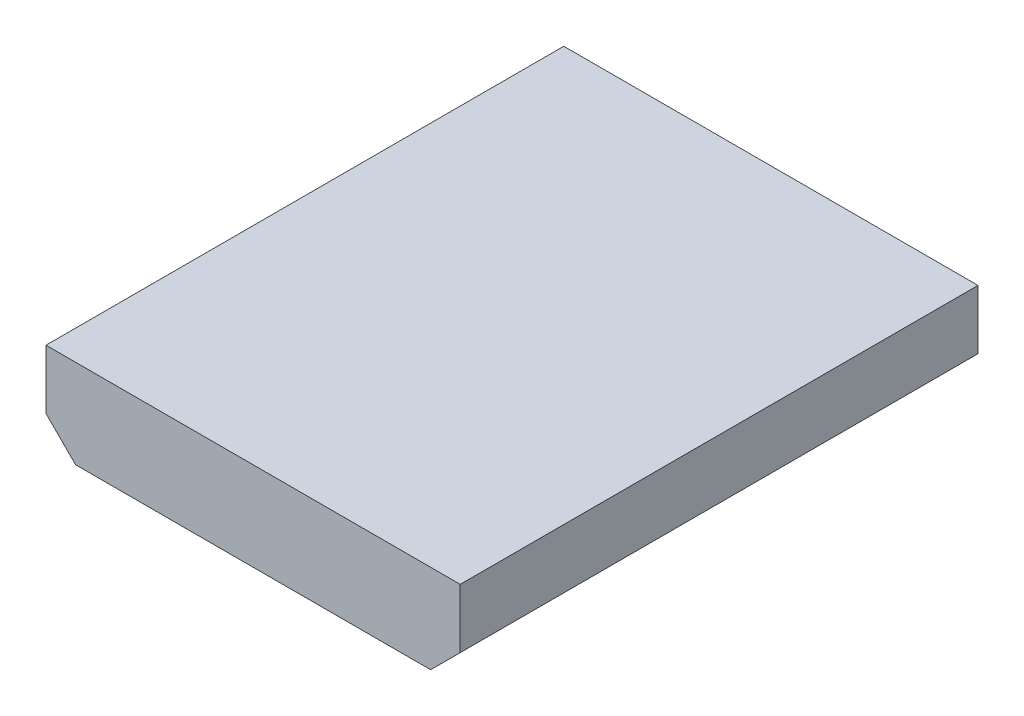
ISO-10303-21;
HEADER;
FILE_DESCRIPTION(('STEP AP214'),'2;1');
FILE_NAME('part.step','',(''),(''),'','','');
FILE_SCHEMA(('AUTOMOTIVE_DESIGN { 1 0 10303 214 1 1 1 1 }'));
ENDSEC;
DATA;
#1=APPLICATION_CONTEXT('core data for automotive mechanical design processes');
#2=APPLICATION_PROTOCOL_DEFINITION('international standard','automotive_design',2000,#1);
#3=PRODUCT_CONTEXT('',#1,'mechanical');
#4=PRODUCT('Part','Part','',(#3));
#5=PRODUCT_RELATED_PRODUCT_CATEGORY('part','',(#4));
#6=PRODUCT_DEFINITION_FORMATION('','',#4);
#7=PRODUCT_DEFINITION_CONTEXT('part definition',#1,'design');
#8=PRODUCT_DEFINITION('design','',#6,#7);
#9=PRODUCT_DEFINITION_SHAPE('','',#8);
#10=(LENGTH_UNIT() NAMED_UNIT(*) SI_UNIT(.MILLI.,.METRE.));
#11=(NAMED_UNIT(*) PLANE_ANGLE_UNIT() SI_UNIT($,.RADIAN.));
#12=(NAMED_UNIT(*) SI_UNIT($,.STERADIAN.) SOLID_ANGLE_UNIT());
#13=UNCERTAINTY_MEASURE_WITH_UNIT(LENGTH_MEASURE(1.E-05),#10,'distance_accuracy_value','');
#14=(GEOMETRIC_REPRESENTATION_CONTEXT(3) GLOBAL_UNCERTAINTY_ASSIGNED_CONTEXT((#13)) GLOBAL_UNIT_ASSIGNED_CONTEXT((#10,
#11,#12)) REPRESENTATION_CONTEXT('',''));
#15=CARTESIAN_POINT('',(0.,0.,0.));
#16=DIRECTION('',(0.,0.,1.));
#17=DIRECTION('',(1.,0.,0.));
#18=AXIS2_PLACEMENT_3D('',#15,#16,#17);
#19=CARTESIAN_POINT('',(-4.5,-4.5,8.75));
#20=DIRECTION('',(0.707106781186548,0.707106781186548,0.));
#21=DIRECTION('',(-0.707106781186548,0.707106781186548,0.));
#22=AXIS2_PLACEMENT_3D('',#19,#20,#21);
#23=PLANE('',#22);
#24=DIRECTION('',(0.707106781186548,-0.707106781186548,0.));
#25=VECTOR('',#24,1.);
#26=CARTESIAN_POINT('',(-4.5,-4.5,-8.75));
#27=LINE('',#26,#25);
#28=CARTESIAN_POINT('',(-7.,-2.,-8.75));
#29=VERTEX_POINT('',#28);
#30=CARTESIAN_POINT('',(-6.,-3.,-8.75));
#31=VERTEX_POINT('',#30);
#32=EDGE_CURVE('E119',#29,#31,#27,.T.);
#33=ORIENTED_EDGE('',*,*,#32,.T.);
#34=DIRECTION('',(0.,0.,-1.));
#35=VECTOR('',#34,1.);
#36=CARTESIAN_POINT('',(-6.,-3.,8.75));
#37=LINE('',#36,#35);
#38=CARTESIAN_POINT('',(-6.,-3.,8.75));
#39=VERTEX_POINT('',#38);
#40=EDGE_CURVE('E11',#39,#31,#37,.T.);
#41=ORIENTED_EDGE('',*,*,#40,.F.);
#42=DIRECTION('',(0.707106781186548,-0.707106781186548,0.));
#43=VECTOR('',#42,1.);
#44=CARTESIAN_POINT('',(-4.5,-4.5,8.75));
#45=LINE('',#44,#43);
#46=CARTESIAN_POINT('',(-7.,-2.,8.75));
#47=VERTEX_POINT('',#46);
#48=EDGE_CURVE('E129',#47,#39,#45,.T.);
#49=ORIENTED_EDGE('',*,*,#48,.F.);
#50=DIRECTION('',(0.,0.,-1.));
#51=VECTOR('',#50,1.);
#52=CARTESIAN_POINT('',(-7.,-2.,8.75));
#53=LINE('',#52,#51);
#54=EDGE_CURVE('E115',#47,#29,#53,.T.);
#55=ORIENTED_EDGE('',*,*,#54,.T.);
#56=EDGE_LOOP('',(#33,#41,#49,#55));
#57=FACE_BOUND('',#56,.T.);
#58=ADVANCED_FACE('F35',(#57),#23,.F.);
#59=CARTESIAN_POINT('',(0.,-3.,8.75));
#60=DIRECTION('',(0.,1.,0.));
#61=DIRECTION('',(0.,0.,1.));
#62=AXIS2_PLACEMENT_3D('',#59,#60,#61);
#63=PLANE('',#62);
#64=DIRECTION('',(1.,0.,0.));
#65=VECTOR('',#64,1.);
#66=CARTESIAN_POINT('',(0.,-3.,-8.75));
#67=LINE('',#66,#65);
#68=CARTESIAN_POINT('',(6.,-3.,-8.75));
#69=VERTEX_POINT('',#68);
#70=EDGE_CURVE('E122',#31,#69,#67,.T.);
#71=ORIENTED_EDGE('',*,*,#70,.T.);
#72=DIRECTION('',(0.,0.,-1.));
#73=VECTOR('',#72,1.);
#74=CARTESIAN_POINT('',(6.,-3.,8.75));
#75=LINE('',#74,#73);
#76=CARTESIAN_POINT('',(6.,-3.,8.75));
#77=VERTEX_POINT('',#76);
#78=EDGE_CURVE('E43',#77,#69,#75,.T.);
#79=ORIENTED_EDGE('',*,*,#78,.F.);
#80=DIRECTION('',(1.,0.,0.));
#81=VECTOR('',#80,1.);
#82=CARTESIAN_POINT('',(0.,-3.,8.75));
#83=LINE('',#82,#81);
#84=EDGE_CURVE('E88',#39,#77,#83,.T.);
#85=ORIENTED_EDGE('',*,*,#84,.F.);
#86=ORIENTED_EDGE('',*,*,#40,.T.);
#87=EDGE_LOOP('',(#71,#79,#85,#86));
#88=FACE_BOUND('',#87,.T.);
#89=ADVANCED_FACE('F153',(#88),#63,.F.);
#90=CARTESIAN_POINT('',(4.5,-4.5,8.75));
#91=DIRECTION('',(-0.707106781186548,0.707106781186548,0.));
#92=DIRECTION('',(-0.707106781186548,-0.707106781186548,0.));
#93=AXIS2_PLACEMENT_3D('',#90,#91,#92);
#94=PLANE('',#93);
#95=DIRECTION('',(0.707106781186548,0.707106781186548,0.));
#96=VECTOR('',#95,1.);
#97=CARTESIAN_POINT('',(4.5,-4.5,-8.75));
#98=LINE('',#97,#96);
#99=CARTESIAN_POINT('',(7.,-2.,-8.75));
#100=VERTEX_POINT('',#99);
#101=EDGE_CURVE('E124',#69,#100,#98,.T.);
#102=ORIENTED_EDGE('',*,*,#101,.T.);
#103=DIRECTION('',(0.,0.,-1.));
#104=VECTOR('',#103,1.);
#105=CARTESIAN_POINT('',(7.,-2.,8.75));
#106=LINE('',#105,#104);
#107=CARTESIAN_POINT('',(7.,-2.,8.75));
#108=VERTEX_POINT('',#107);
#109=EDGE_CURVE('E110',#108,#100,#106,.T.);
#110=ORIENTED_EDGE('',*,*,#109,.F.);
#111=DIRECTION('',(0.707106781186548,0.707106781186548,0.));
#112=VECTOR('',#111,1.);
#113=CARTESIAN_POINT('',(4.5,-4.5,8.75));
#114=LINE('',#113,#112);
#115=EDGE_CURVE('E101',#77,#108,#114,.T.);
#116=ORIENTED_EDGE('',*,*,#115,.F.);
#117=ORIENTED_EDGE('',*,*,#78,.T.);
#118=EDGE_LOOP('',(#102,#110,#116,#117));
#119=FACE_BOUND('',#118,.T.);
#120=ADVANCED_FACE('F135',(#119),#94,.F.);
#121=CARTESIAN_POINT('',(7.,0.,8.75));
#122=DIRECTION('',(-1.,0.,0.));
#123=DIRECTION('',(0.,0.,1.));
#124=AXIS2_PLACEMENT_3D('',#121,#122,#123);
#125=PLANE('',#124);
#126=DIRECTION('',(0.,1.,0.));
#127=VECTOR('',#126,1.);
#128=CARTESIAN_POINT('',(7.,0.,-8.75));
#129=LINE('',#128,#127);
#130=CARTESIAN_POINT('',(7.,0.,-8.75));
#131=VERTEX_POINT('',#130);
#132=EDGE_CURVE('E109',#100,#131,#129,.T.);
#133=ORIENTED_EDGE('',*,*,#132,.T.);
#134=DIRECTION('',(0.,0.,-1.));
#135=VECTOR('',#134,1.);
#136=CARTESIAN_POINT('',(7.,0.,8.75));
#137=LINE('',#136,#135);
#138=CARTESIAN_POINT('',(7.,0.,8.75));
#139=VERTEX_POINT('',#138);
#140=EDGE_CURVE('E106',#139,#131,#137,.T.);
#141=ORIENTED_EDGE('',*,*,#140,.F.);
#142=DIRECTION('',(0.,1.,0.));
#143=VECTOR('',#142,1.);
#144=CARTESIAN_POINT('',(7.,0.,8.75));
#145=LINE('',#144,#143);
#146=EDGE_CURVE('E95',#108,#139,#145,.T.);
#147=ORIENTED_EDGE('',*,*,#146,.F.);
#148=ORIENTED_EDGE('',*,*,#109,.T.);
#149=EDGE_LOOP('',(#133,#141,#147,#148));
#150=FACE_BOUND('',#149,.T.);
#151=ADVANCED_FACE('F107',(#150),#125,.F.);
#152=CARTESIAN_POINT('',(0.,0.,8.75));
#153=DIRECTION('',(0.,-1.,0.));
#154=DIRECTION('',(0.,0.,-1.));
#155=AXIS2_PLACEMENT_3D('',#152,#153,#154);
#156=PLANE('',#155);
#157=DIRECTION('',(-1.,0.,0.));
#158=VECTOR('',#157,1.);
#159=CARTESIAN_POINT('',(0.,0.,-8.75));
#160=LINE('',#159,#158);
#161=CARTESIAN_POINT('',(-7.,0.,-8.75));
#162=VERTEX_POINT('',#161);
#163=EDGE_CURVE('E74',#131,#162,#160,.T.);
#164=ORIENTED_EDGE('',*,*,#163,.T.);
#165=DIRECTION('',(0.,0.,-1.));
#166=VECTOR('',#165,1.);
#167=CARTESIAN_POINT('',(-7.,0.,8.75));
#168=LINE('',#167,#166);
#169=CARTESIAN_POINT('',(-7.,0.,8.75));
#170=VERTEX_POINT('',#169);
#171=EDGE_CURVE('E111',#170,#162,#168,.T.);
#172=ORIENTED_EDGE('',*,*,#171,.F.);
#173=DIRECTION('',(-1.,0.,0.));
#174=VECTOR('',#173,1.);
#175=CARTESIAN_POINT('',(0.,0.,8.75));
#176=LINE('',#175,#174);
#177=EDGE_CURVE('E99',#139,#170,#176,.T.);
#178=ORIENTED_EDGE('',*,*,#177,.F.);
#179=ORIENTED_EDGE('',*,*,#140,.T.);
#180=EDGE_LOOP('',(#164,#172,#178,#179));
#181=FACE_BOUND('',#180,.T.);
#182=ADVANCED_FACE('F113',(#181),#156,.F.);
#183=CARTESIAN_POINT('',(-7.,0.,8.75));
#184=DIRECTION('',(1.,0.,0.));
#185=DIRECTION('',(0.,0.,-1.));
#186=AXIS2_PLACEMENT_3D('',#183,#184,#185);
#187=PLANE('',#186);
#188=DIRECTION('',(0.,-1.,0.));
#189=VECTOR('',#188,1.);
#190=CARTESIAN_POINT('',(-7.,0.,-8.75));
#191=LINE('',#190,#189);
#192=EDGE_CURVE('E80',#162,#29,#191,.T.);
#193=ORIENTED_EDGE('',*,*,#192,.T.);
#194=ORIENTED_EDGE('',*,*,#54,.F.);
#195=DIRECTION('',(0.,-1.,0.));
#196=VECTOR('',#195,1.);
#197=CARTESIAN_POINT('',(-7.,0.,8.75));
#198=LINE('',#197,#196);
#199=EDGE_CURVE('E51',#170,#47,#198,.T.);
#200=ORIENTED_EDGE('',*,*,#199,.F.);
#201=ORIENTED_EDGE('',*,*,#171,.T.);
#202=EDGE_LOOP('',(#193,#194,#200,#201));
#203=FACE_BOUND('',#202,.T.);
#204=ADVANCED_FACE('F142',(#203),#187,.F.);
#205=CARTESIAN_POINT('',(0.,0.,8.75));
#206=DIRECTION('',(0.,0.,1.));
#207=DIRECTION('',(1.,0.,0.));
#208=AXIS2_PLACEMENT_3D('',#205,#206,#207);
#209=PLANE('',#208);
#210=ORIENTED_EDGE('',*,*,#48,.T.);
#211=ORIENTED_EDGE('',*,*,#84,.T.);
#212=ORIENTED_EDGE('',*,*,#115,.T.);
#213=ORIENTED_EDGE('',*,*,#146,.T.);
#214=ORIENTED_EDGE('',*,*,#177,.T.);
#215=ORIENTED_EDGE('',*,*,#199,.T.);
#216=EDGE_LOOP('',(#210,#211,#212,#213,#214,#215));
#217=FACE_BOUND('',#216,.T.);
#218=ADVANCED_FACE('F97',(#217),#209,.T.);
#219=CARTESIAN_POINT('',(0.,0.,-8.75));
#220=DIRECTION('',(0.,0.,1.));
#221=DIRECTION('',(1.,0.,0.));
#222=AXIS2_PLACEMENT_3D('',#219,#220,#221);
#223=PLANE('',#222);
#224=ORIENTED_EDGE('',*,*,#32,.F.);
#225=ORIENTED_EDGE('',*,*,#192,.F.);
#226=ORIENTED_EDGE('',*,*,#163,.F.);
#227=ORIENTED_EDGE('',*,*,#132,.F.);
#228=ORIENTED_EDGE('',*,*,#101,.F.);
#229=ORIENTED_EDGE('',*,*,#70,.F.);
#230=EDGE_LOOP('',(#224,#225,#226,#227,#228,#229));
#231=FACE_BOUND('',#230,.T.);
#232=ADVANCED_FACE('F138',(#231),#223,.F.);
#233=CLOSED_SHELL('',(#58,#89,#120,#151,#182,#204,#218,#232));
#234=MANIFOLD_SOLID_BREP('B2',#233);
#235=ADVANCED_BREP_SHAPE_REPRESENTATION('',(#18,#234),#14);
#236=SHAPE_DEFINITION_REPRESENTATION(#9,#235);
ENDSEC;
END-ISO-10303-21;
